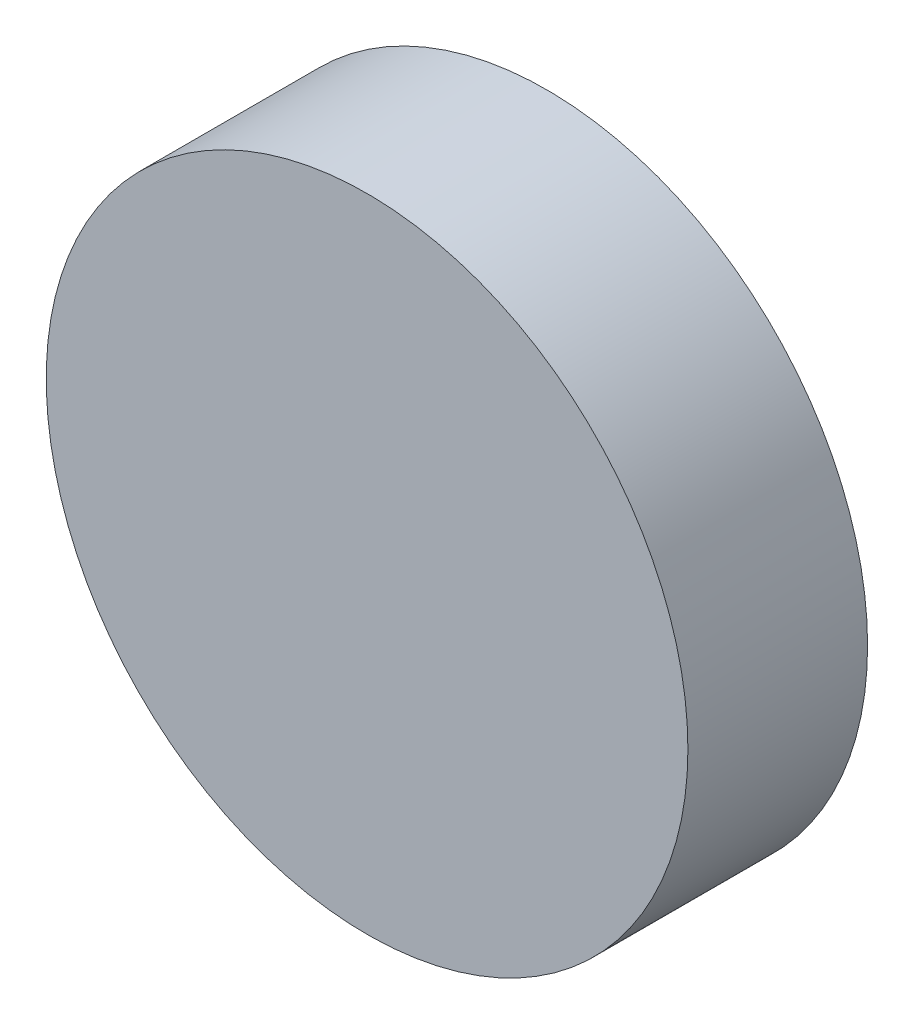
from build123d import *

# Parameters (mm, degrees)
EXTRUDE_125_35_DEPTH      = 17.5
EXTRUDE_125_35_DEPTH_BACK = 17.5
SKETCH_1_R                = 62.5


with BuildPart() as part:
    # Sketch 1 → Extrude 125 _ 35 (new, two sides: drawn at the far end of the back side and taken through both)
    with BuildSketch(Plane.XY.offset(-EXTRUDE_125_35_DEPTH_BACK)):
        Circle(SKETCH_1_R)
    extrude(amount=EXTRUDE_125_35_DEPTH + EXTRUDE_125_35_DEPTH_BACK)


solid = part.part
